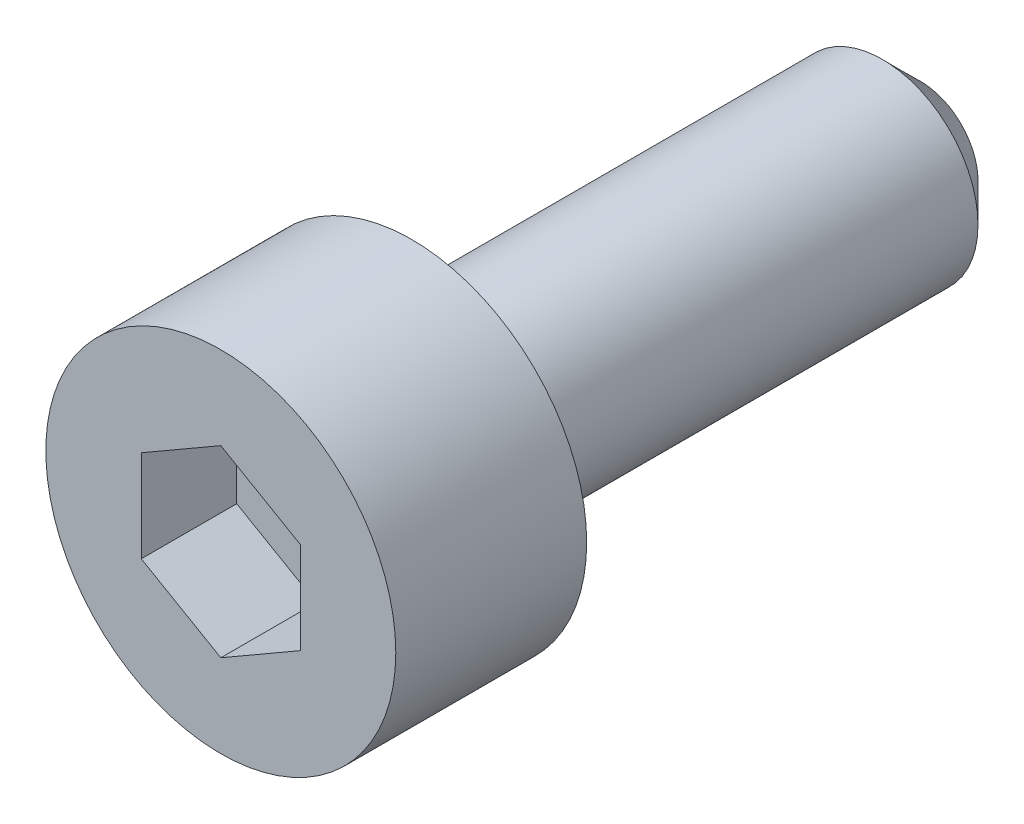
ISO-10303-21;
HEADER;
FILE_DESCRIPTION(('STEP AP214'),'2;1');
FILE_NAME('part.step','',(''),(''),'','','');
FILE_SCHEMA(('AUTOMOTIVE_DESIGN { 1 0 10303 214 1 1 1 1 }'));
ENDSEC;
DATA;
#1=APPLICATION_CONTEXT('core data for automotive mechanical design processes');
#2=APPLICATION_PROTOCOL_DEFINITION('international standard','automotive_design',2000,#1);
#3=PRODUCT_CONTEXT('',#1,'mechanical');
#4=PRODUCT('Part','Part','',(#3));
#5=PRODUCT_RELATED_PRODUCT_CATEGORY('part','',(#4));
#6=PRODUCT_DEFINITION_FORMATION('','',#4);
#7=PRODUCT_DEFINITION_CONTEXT('part definition',#1,'design');
#8=PRODUCT_DEFINITION('design','',#6,#7);
#9=PRODUCT_DEFINITION_SHAPE('','',#8);
#10=(LENGTH_UNIT() NAMED_UNIT(*) SI_UNIT(.MILLI.,.METRE.));
#11=(NAMED_UNIT(*) PLANE_ANGLE_UNIT() SI_UNIT($,.RADIAN.));
#12=(NAMED_UNIT(*) SI_UNIT($,.STERADIAN.) SOLID_ANGLE_UNIT());
#13=UNCERTAINTY_MEASURE_WITH_UNIT(LENGTH_MEASURE(1.E-05),#10,'distance_accuracy_value','');
#14=(GEOMETRIC_REPRESENTATION_CONTEXT(3) GLOBAL_UNCERTAINTY_ASSIGNED_CONTEXT((#13)) GLOBAL_UNIT_ASSIGNED_CONTEXT((#10,
#11,#12)) REPRESENTATION_CONTEXT('',''));
#15=CARTESIAN_POINT('',(0.,0.,0.));
#16=DIRECTION('',(0.,0.,1.));
#17=DIRECTION('',(1.,0.,0.));
#18=AXIS2_PLACEMENT_3D('',#15,#16,#17);
#19=CARTESIAN_POINT('',(0.,1.44337567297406,1.5));
#20=DIRECTION('',(-0.5,-0.86602540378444,0.));
#21=DIRECTION('',(0.86602540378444,-0.5,0.));
#22=AXIS2_PLACEMENT_3D('',#19,#20,#21);
#23=PLANE('',#22);
#24=DIRECTION('',(0.,0.,1.));
#25=VECTOR('',#24,1.);
#26=CARTESIAN_POINT('',(1.25,0.721687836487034,1.5));
#27=LINE('',#26,#25);
#28=CARTESIAN_POINT('',(1.25,0.721687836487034,1.5));
#29=VERTEX_POINT('',#28);
#30=CARTESIAN_POINT('',(1.25,0.721687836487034,3.));
#31=VERTEX_POINT('',#30);
#32=EDGE_CURVE('E63',#29,#31,#27,.T.);
#33=ORIENTED_EDGE('',*,*,#32,.T.);
#34=DIRECTION('',(0.866025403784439,-0.5,0.));
#35=VECTOR('',#34,1.);
#36=CARTESIAN_POINT('',(0.,1.44337567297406,3.));
#37=LINE('',#36,#35);
#38=CARTESIAN_POINT('',(0.,1.44337567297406,3.));
#39=VERTEX_POINT('',#38);
#40=EDGE_CURVE('E29',#39,#31,#37,.T.);
#41=ORIENTED_EDGE('',*,*,#40,.F.);
#42=DIRECTION('',(0.,0.,1.));
#43=VECTOR('',#42,1.);
#44=CARTESIAN_POINT('',(0.,1.44337567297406,1.5));
#45=LINE('',#44,#43);
#46=CARTESIAN_POINT('',(0.,1.44337567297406,1.5));
#47=VERTEX_POINT('',#46);
#48=EDGE_CURVE('E33',#47,#39,#45,.T.);
#49=ORIENTED_EDGE('',*,*,#48,.F.);
#50=DIRECTION('',(0.866025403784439,-0.5,0.));
#51=VECTOR('',#50,1.);
#52=CARTESIAN_POINT('',(0.,1.44337567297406,1.5));
#53=LINE('',#52,#51);
#54=EDGE_CURVE('E65',#47,#29,#53,.T.);
#55=ORIENTED_EDGE('',*,*,#54,.T.);
#56=EDGE_LOOP('',(#33,#41,#49,#55));
#57=FACE_BOUND('',#56,.T.);
#58=ADVANCED_FACE('F14',(#57),#23,.T.);
#59=CARTESIAN_POINT('',(1.25,-0.721687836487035,1.5));
#60=DIRECTION('',(1.,0.,0.));
#61=DIRECTION('',(0.,1.,0.));
#62=AXIS2_PLACEMENT_3D('',#59,#60,#61);
#63=PLANE('',#62);
#64=DIRECTION('',(0.,0.,1.));
#65=VECTOR('',#64,1.);
#66=CARTESIAN_POINT('',(1.25,-0.721687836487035,1.5));
#67=LINE('',#66,#65);
#68=CARTESIAN_POINT('',(1.25,-0.721687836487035,1.5));
#69=VERTEX_POINT('',#68);
#70=CARTESIAN_POINT('',(1.25,-0.721687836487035,3.));
#71=VERTEX_POINT('',#70);
#72=EDGE_CURVE('E70',#69,#71,#67,.T.);
#73=ORIENTED_EDGE('',*,*,#72,.T.);
#74=DIRECTION('',(0.,1.,0.));
#75=VECTOR('',#74,1.);
#76=CARTESIAN_POINT('',(1.25,-0.721687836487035,3.));
#77=LINE('',#76,#75);
#78=EDGE_CURVE('E73',#71,#31,#77,.T.);
#79=ORIENTED_EDGE('',*,*,#78,.T.);
#80=ORIENTED_EDGE('',*,*,#32,.F.);
#81=DIRECTION('',(0.,1.,0.));
#82=VECTOR('',#81,1.);
#83=CARTESIAN_POINT('',(1.25,-0.721687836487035,1.5));
#84=LINE('',#83,#82);
#85=EDGE_CURVE('E100',#69,#29,#84,.T.);
#86=ORIENTED_EDGE('',*,*,#85,.F.);
#87=EDGE_LOOP('',(#73,#79,#80,#86));
#88=FACE_BOUND('',#87,.T.);
#89=ADVANCED_FACE('F74',(#88),#63,.F.);
#90=CARTESIAN_POINT('',(0.,-1.44337567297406,1.5));
#91=DIRECTION('',(0.5,-0.86602540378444,0.));
#92=DIRECTION('',(0.86602540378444,0.5,0.));
#93=AXIS2_PLACEMENT_3D('',#90,#91,#92);
#94=PLANE('',#93);
#95=DIRECTION('',(0.,0.,1.));
#96=VECTOR('',#95,1.);
#97=CARTESIAN_POINT('',(0.,-1.44337567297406,1.5));
#98=LINE('',#97,#96);
#99=CARTESIAN_POINT('',(0.,-1.44337567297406,1.5));
#100=VERTEX_POINT('',#99);
#101=CARTESIAN_POINT('',(0.,-1.44337567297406,3.));
#102=VERTEX_POINT('',#101);
#103=EDGE_CURVE('E108',#100,#102,#98,.T.);
#104=ORIENTED_EDGE('',*,*,#103,.T.);
#105=DIRECTION('',(0.86602540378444,0.5,0.));
#106=VECTOR('',#105,1.);
#107=CARTESIAN_POINT('',(0.,-1.44337567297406,3.));
#108=LINE('',#107,#106);
#109=EDGE_CURVE('E78',#102,#71,#108,.T.);
#110=ORIENTED_EDGE('',*,*,#109,.T.);
#111=ORIENTED_EDGE('',*,*,#72,.F.);
#112=DIRECTION('',(0.86602540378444,0.5,0.));
#113=VECTOR('',#112,1.);
#114=CARTESIAN_POINT('',(0.,-1.44337567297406,1.5));
#115=LINE('',#114,#113);
#116=EDGE_CURVE('E97',#100,#69,#115,.T.);
#117=ORIENTED_EDGE('',*,*,#116,.F.);
#118=EDGE_LOOP('',(#104,#110,#111,#117));
#119=FACE_BOUND('',#118,.T.);
#120=ADVANCED_FACE('F139',(#119),#94,.F.);
#121=CARTESIAN_POINT('',(0.,-1.44337567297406,1.5));
#122=DIRECTION('',(0.5,0.86602540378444,0.));
#123=DIRECTION('',(-0.86602540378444,0.5,0.));
#124=AXIS2_PLACEMENT_3D('',#121,#122,#123);
#125=PLANE('',#124);
#126=DIRECTION('',(0.,0.,1.));
#127=VECTOR('',#126,1.);
#128=CARTESIAN_POINT('',(-1.25,-0.721687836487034,1.5));
#129=LINE('',#128,#127);
#130=CARTESIAN_POINT('',(-1.25,-0.721687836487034,1.5));
#131=VERTEX_POINT('',#130);
#132=CARTESIAN_POINT('',(-1.25,-0.721687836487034,3.));
#133=VERTEX_POINT('',#132);
#134=EDGE_CURVE('E106',#131,#133,#129,.T.);
#135=ORIENTED_EDGE('',*,*,#134,.T.);
#136=DIRECTION('',(-0.86602540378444,0.5,0.));
#137=VECTOR('',#136,1.);
#138=CARTESIAN_POINT('',(0.,-1.44337567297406,3.));
#139=LINE('',#138,#137);
#140=EDGE_CURVE('E185',#102,#133,#139,.T.);
#141=ORIENTED_EDGE('',*,*,#140,.F.);
#142=ORIENTED_EDGE('',*,*,#103,.F.);
#143=DIRECTION('',(-0.86602540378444,0.5,0.));
#144=VECTOR('',#143,1.);
#145=CARTESIAN_POINT('',(0.,-1.44337567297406,1.5));
#146=LINE('',#145,#144);
#147=EDGE_CURVE('E94',#100,#131,#146,.T.);
#148=ORIENTED_EDGE('',*,*,#147,.T.);
#149=EDGE_LOOP('',(#135,#141,#142,#148));
#150=FACE_BOUND('',#149,.T.);
#151=ADVANCED_FACE('F151',(#150),#125,.T.);
#152=CARTESIAN_POINT('',(-1.25,0.721687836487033,1.5));
#153=DIRECTION('',(-1.,0.,0.));
#154=DIRECTION('',(0.,-1.,0.));
#155=AXIS2_PLACEMENT_3D('',#152,#153,#154);
#156=PLANE('',#155);
#157=DIRECTION('',(0.,0.,1.));
#158=VECTOR('',#157,1.);
#159=CARTESIAN_POINT('',(-1.25,0.721687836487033,1.5));
#160=LINE('',#159,#158);
#161=CARTESIAN_POINT('',(-1.25,0.721687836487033,1.5));
#162=VERTEX_POINT('',#161);
#163=CARTESIAN_POINT('',(-1.25,0.721687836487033,3.));
#164=VERTEX_POINT('',#163);
#165=EDGE_CURVE('E104',#162,#164,#160,.T.);
#166=ORIENTED_EDGE('',*,*,#165,.T.);
#167=DIRECTION('',(0.,-1.,0.));
#168=VECTOR('',#167,1.);
#169=CARTESIAN_POINT('',(-1.25,0.721687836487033,3.));
#170=LINE('',#169,#168);
#171=EDGE_CURVE('E186',#164,#133,#170,.T.);
#172=ORIENTED_EDGE('',*,*,#171,.T.);
#173=ORIENTED_EDGE('',*,*,#134,.F.);
#174=DIRECTION('',(0.,-1.,0.));
#175=VECTOR('',#174,1.);
#176=CARTESIAN_POINT('',(-1.25,0.721687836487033,1.5));
#177=LINE('',#176,#175);
#178=EDGE_CURVE('E91',#162,#131,#177,.T.);
#179=ORIENTED_EDGE('',*,*,#178,.F.);
#180=EDGE_LOOP('',(#166,#172,#173,#179));
#181=FACE_BOUND('',#180,.T.);
#182=ADVANCED_FACE('F147',(#181),#156,.F.);
#183=CARTESIAN_POINT('',(0.,1.44337567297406,1.5));
#184=DIRECTION('',(-0.5,0.86602540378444,0.));
#185=DIRECTION('',(-0.86602540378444,-0.5,0.));
#186=AXIS2_PLACEMENT_3D('',#183,#184,#185);
#187=PLANE('',#186);
#188=DIRECTION('',(-0.86602540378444,-0.5,0.));
#189=VECTOR('',#188,1.);
#190=CARTESIAN_POINT('',(0.,1.44337567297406,1.5));
#191=LINE('',#190,#189);
#192=EDGE_CURVE('E88',#47,#162,#191,.T.);
#193=ORIENTED_EDGE('',*,*,#192,.F.);
#194=ORIENTED_EDGE('',*,*,#48,.T.);
#195=DIRECTION('',(-0.86602540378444,-0.5,0.));
#196=VECTOR('',#195,1.);
#197=CARTESIAN_POINT('',(0.,1.44337567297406,3.));
#198=LINE('',#197,#196);
#199=EDGE_CURVE('E84',#39,#164,#198,.T.);
#200=ORIENTED_EDGE('',*,*,#199,.T.);
#201=ORIENTED_EDGE('',*,*,#165,.F.);
#202=EDGE_LOOP('',(#193,#194,#200,#201));
#203=FACE_BOUND('',#202,.T.);
#204=ADVANCED_FACE('F144',(#203),#187,.F.);
#205=CARTESIAN_POINT('',(1.25,0.721687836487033,1.5));
#206=DIRECTION('',(0.,0.,1.));
#207=DIRECTION('',(1.,0.,0.));
#208=AXIS2_PLACEMENT_3D('',#205,#206,#207);
#209=PLANE('',#208);
#210=ORIENTED_EDGE('',*,*,#54,.F.);
#211=ORIENTED_EDGE('',*,*,#192,.T.);
#212=ORIENTED_EDGE('',*,*,#178,.T.);
#213=ORIENTED_EDGE('',*,*,#147,.F.);
#214=ORIENTED_EDGE('',*,*,#116,.T.);
#215=ORIENTED_EDGE('',*,*,#85,.T.);
#216=EDGE_LOOP('',(#210,#211,#212,#213,#214,#215));
#217=FACE_BOUND('',#216,.T.);
#218=ADVANCED_FACE('F143',(#217),#209,.T.);
#219=CARTESIAN_POINT('',(0.,0.,3.));
#220=DIRECTION('',(0.,0.,1.));
#221=DIRECTION('',(1.,0.,0.));
#222=AXIS2_PLACEMENT_3D('',#219,#220,#221);
#223=PLANE('',#222);
#224=CARTESIAN_POINT('',(0.,0.,3.));
#225=DIRECTION('',(0.,0.,1.));
#226=DIRECTION('',(1.,0.,0.));
#227=AXIS2_PLACEMENT_3D('',#224,#225,#226);
#228=CIRCLE('',#227,2.75);
#229=CARTESIAN_POINT('',(2.75,0.,3.));
#230=VERTEX_POINT('',#229);
#231=EDGE_CURVE('E116',#230,#230,#228,.T.);
#232=ORIENTED_EDGE('',*,*,#231,.T.);
#233=EDGE_LOOP('',(#232));
#234=FACE_BOUND('',#233,.T.);
#235=ORIENTED_EDGE('',*,*,#199,.F.);
#236=ORIENTED_EDGE('',*,*,#40,.T.);
#237=ORIENTED_EDGE('',*,*,#78,.F.);
#238=ORIENTED_EDGE('',*,*,#109,.F.);
#239=ORIENTED_EDGE('',*,*,#140,.T.);
#240=ORIENTED_EDGE('',*,*,#171,.F.);
#241=EDGE_LOOP('',(#235,#236,#237,#238,#239,#240));
#242=FACE_BOUND('',#241,.T.);
#243=ADVANCED_FACE('F81',(#234,#242),#223,.T.);
#244=CARTESIAN_POINT('',(0.,0.,12.));
#245=DIRECTION('',(0.,0.,1.));
#246=DIRECTION('',(1.,0.,0.));
#247=AXIS2_PLACEMENT_3D('',#244,#245,#246);
#248=CYLINDRICAL_SURFACE('',#247,2.75);
#249=CARTESIAN_POINT('',(0.,0.,0.));
#250=DIRECTION('',(0.,0.,1.));
#251=DIRECTION('',(1.,0.,0.));
#252=AXIS2_PLACEMENT_3D('',#249,#250,#251);
#253=CIRCLE('',#252,2.75);
#254=CARTESIAN_POINT('',(2.75,0.,0.));
#255=VERTEX_POINT('',#254);
#256=EDGE_CURVE('E113',#255,#255,#253,.T.);
#257=ORIENTED_EDGE('',*,*,#256,.T.);
#258=EDGE_LOOP('',(#257));
#259=FACE_BOUND('',#258,.T.);
#260=ORIENTED_EDGE('',*,*,#231,.F.);
#261=EDGE_LOOP('',(#260));
#262=FACE_BOUND('',#261,.T.);
#263=ADVANCED_FACE('F164',(#259,#262),#248,.T.);
#264=CARTESIAN_POINT('',(2.75,0.,0.));
#265=DIRECTION('',(0.,0.,-1.));
#266=DIRECTION('',(-1.,0.,0.));
#267=AXIS2_PLACEMENT_3D('',#264,#265,#266);
#268=PLANE('',#267);
#269=CARTESIAN_POINT('',(0.,0.,0.));
#270=DIRECTION('',(0.,0.,1.));
#271=DIRECTION('',(1.,0.,0.));
#272=AXIS2_PLACEMENT_3D('',#269,#270,#271);
#273=CIRCLE('',#272,1.5);
#274=CARTESIAN_POINT('',(1.5,0.,0.));
#275=VERTEX_POINT('',#274);
#276=EDGE_CURVE('E69',#275,#275,#273,.T.);
#277=ORIENTED_EDGE('',*,*,#276,.T.);
#278=EDGE_LOOP('',(#277));
#279=FACE_BOUND('',#278,.T.);
#280=ORIENTED_EDGE('',*,*,#256,.F.);
#281=EDGE_LOOP('',(#280));
#282=FACE_BOUND('',#281,.T.);
#283=ADVANCED_FACE('F161',(#279,#282),#268,.T.);
#284=CARTESIAN_POINT('',(0.,0.,12.));
#285=DIRECTION('',(0.,0.,1.));
#286=DIRECTION('',(1.,0.,0.));
#287=AXIS2_PLACEMENT_3D('',#284,#285,#286);
#288=CYLINDRICAL_SURFACE('',#287,1.5);
#289=CARTESIAN_POINT('',(0.,0.,-7.4));
#290=DIRECTION('',(0.,0.,-1.));
#291=DIRECTION('',(-1.,0.,0.));
#292=AXIS2_PLACEMENT_3D('',#289,#290,#291);
#293=CIRCLE('',#292,1.5);
#294=CARTESIAN_POINT('',(-1.5,0.,-7.4));
#295=VERTEX_POINT('',#294);
#296=EDGE_CURVE('E22',#295,#295,#293,.F.);
#297=ORIENTED_EDGE('',*,*,#296,.T.);
#298=EDGE_LOOP('',(#297));
#299=FACE_BOUND('',#298,.T.);
#300=ORIENTED_EDGE('',*,*,#276,.F.);
#301=EDGE_LOOP('',(#300));
#302=FACE_BOUND('',#301,.T.);
#303=ADVANCED_FACE('F121',(#299,#302),#288,.T.);
#304=CARTESIAN_POINT('',(1.5,0.,-8.));
#305=DIRECTION('',(0.,0.,-1.));
#306=DIRECTION('',(-1.,0.,0.));
#307=AXIS2_PLACEMENT_3D('',#304,#305,#306);
#308=PLANE('',#307);
#309=CARTESIAN_POINT('',(0.,0.,-8.));
#310=DIRECTION('',(0.,0.,-1.));
#311=DIRECTION('',(-1.,0.,0.));
#312=AXIS2_PLACEMENT_3D('',#309,#310,#311);
#313=CIRCLE('',#312,0.9);
#314=CARTESIAN_POINT('',(-0.9,0.,-8.));
#315=VERTEX_POINT('',#314);
#316=EDGE_CURVE('E9',#315,#315,#313,.T.);
#317=ORIENTED_EDGE('',*,*,#316,.T.);
#318=EDGE_LOOP('',(#317));
#319=FACE_BOUND('',#318,.T.);
#320=ADVANCED_FACE('F125',(#319),#308,.T.);
#321=CARTESIAN_POINT('',(0.,0.,-7.4));
#322=DIRECTION('',(0.,0.,1.));
#323=DIRECTION('',(1.,0.,0.));
#324=AXIS2_PLACEMENT_3D('',#321,#322,#323);
#325=CONICAL_SURFACE('',#324,1.5,0.785398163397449);
#326=ORIENTED_EDGE('',*,*,#316,.F.);
#327=EDGE_LOOP('',(#326));
#328=FACE_BOUND('',#327,.T.);
#329=ORIENTED_EDGE('',*,*,#296,.F.);
#330=EDGE_LOOP('',(#329));
#331=FACE_BOUND('',#330,.T.);
#332=ADVANCED_FACE('F16',(#328,#331),#325,.T.);
#333=CLOSED_SHELL('',(#58,#89,#120,#151,#182,#204,#218,#243,#263,#283,#303,#320,#332));
#334=MANIFOLD_SOLID_BREP('B1',#333);
#335=ADVANCED_BREP_SHAPE_REPRESENTATION('',(#18,#334),#14);
#336=SHAPE_DEFINITION_REPRESENTATION(#9,#335);
ENDSEC;
END-ISO-10303-21;
